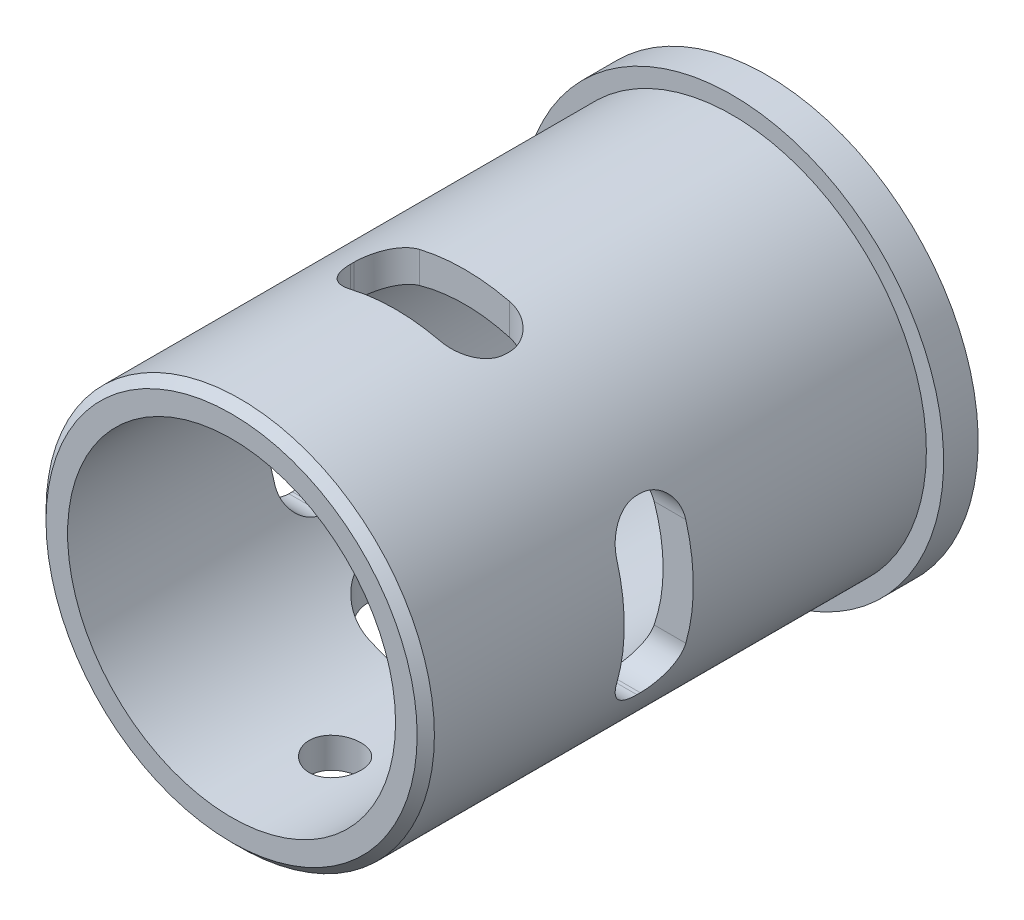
from build123d import *

# Parameters (mm, degrees)
ESQUISSE1_R             = 11.25
ESQUISSE1_R_2           = 9.5
BASE_EXTRUSION_DEPTH    = 31
CHANFREIN1_SIZE         = 0.5
ESQUISSE2_R             = 12.25
ESQUISSE2_R_2           = 11.25
BOSS_EXTRU_MINCE1_DEPTH = 2
ESQUISSE3_R             = 1.5
ENL_V_MAT_EXTRU_1_DEPTH = 36.512321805
ENL_V_MAT_EXTRU_2_DEPTH = 25
ENL_V_MAT_EXTRU_3_DEPTH = 50


with BuildPart() as part:
    # Esquisse1 → Base-Extrusion (new body)
    with BuildSketch(Plane.XY):
        Circle(ESQUISSE1_R)
        Circle(ESQUISSE1_R_2, mode=Mode.SUBTRACT)
    extrude(amount=BASE_EXTRUSION_DEPTH)

    # Chanfrein1
    chanfrein1_edges = [part.edges().sort_by_distance(p)[0] for p in [
        (-11.25, 0, 31),
    ]]
    chamfer(chanfrein1_edges, length=CHANFREIN1_SIZE)

    # Esquisse2 → Boss.-Extru.-Mince1 (add)
    with BuildSketch(Plane(origin=(0, 0, 0), x_dir=(-1, 0, 0), z_dir=(0, 0, -1))):
        Circle(ESQUISSE2_R)
        Circle(ESQUISSE2_R_2, mode=Mode.SUBTRACT)
    extrude(amount=-BOSS_EXTRU_MINCE1_DEPTH)

    # Esquisse3 → Enl_v. mat.-Extru.1 (cut, through all)
    with BuildSketch(Plane(origin=(0, 0, 0), x_dir=(1, 0, 0), z_dir=(0, 1, 0))):
        with Locations(Location((0, -25, 0), (0, 0, 270))):
            Circle(ESQUISSE3_R)
        with BuildLine():
            Line((-4.1, -14), (4.1, -14))
            ThreePointArc((4.1, -14), (5.797056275, -14.702943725), (6.5, -16.4))
            Line((6.5, -16.4), (6.5, -16.6))
            ThreePointArc((6.5, -16.6), (5.797056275, -18.297056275), (4.1, -19))
            Line((4.1, -19), (-4.1, -19))
            ThreePointArc((-4.1, -19), (-5.797056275, -18.297056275), (-6.5, -16.6))
            Line((-6.5, -16.6), (-6.5, -16.4))
            ThreePointArc((-6.5, -16.4), (-5.797056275, -14.702943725), (-4.1, -14))
        make_face()
    extrude(amount=-ENL_V_MAT_EXTRU_1_DEPTH, mode=Mode.SUBTRACT)

    # Esquisse4 → Enl_v. mat.-Extru.2 (cut, symmetric)
    with BuildSketch(Plane(origin=(0, 0, 0), x_dir=(0, 0, -1), z_dir=(1, 0, 0))):
        with BuildLine():
            Line((-17.6, 5), (-17.4, 5))
            ThreePointArc((-17.4, 5), (-16.056497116, 4.443502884), (-15.5, 3.1))
            Line((-15.5, 3.1), (-15.5, -3.1))
            ThreePointArc((-15.5, -3.1), (-16.056497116, -4.443502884), (-17.4, -5))
            Line((-17.4, -5), (-17.6, -5))
            ThreePointArc((-17.6, -5), (-18.943502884, -4.443502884), (-19.5, -3.1))
            Line((-19.5, -3.1), (-19.5, 3.1))
            ThreePointArc((-19.5, 3.1), (-18.943502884, 4.443502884), (-17.6, 5))
        make_face()
    extrude(amount=ENL_V_MAT_EXTRU_2_DEPTH, both=True, mode=Mode.SUBTRACT)

    # Esquisse5 → Enl_v. mat.-Extru.3 (cut)
    with BuildSketch(Plane(origin=(0, 0, 0), x_dir=(1, 0, 0), z_dir=(0, 1, 0))):
        with BuildLine():
            Line((-2.6, -17.5), (2.6, -17.5))
            ThreePointArc((2.6, -17.5), (3.943502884, -18.056497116), (4.5, -19.4))
            Line((4.5, -19.4), (4.5, -19.6))
            ThreePointArc((4.5, -19.6), (3.943502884, -20.943502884), (2.6, -21.5))
            Line((2.6, -21.5), (-2.6, -21.5))
            ThreePointArc((-2.6, -21.5), (-3.943502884, -20.943502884), (-4.5, -19.6))
            Line((-4.5, -19.6), (-4.5, -19.4))
            ThreePointArc((-4.5, -19.4), (-3.943502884, -18.056497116), (-2.6, -17.5))
        make_face()
    extrude(amount=ENL_V_MAT_EXTRU_3_DEPTH, mode=Mode.SUBTRACT)


solid = part.part
